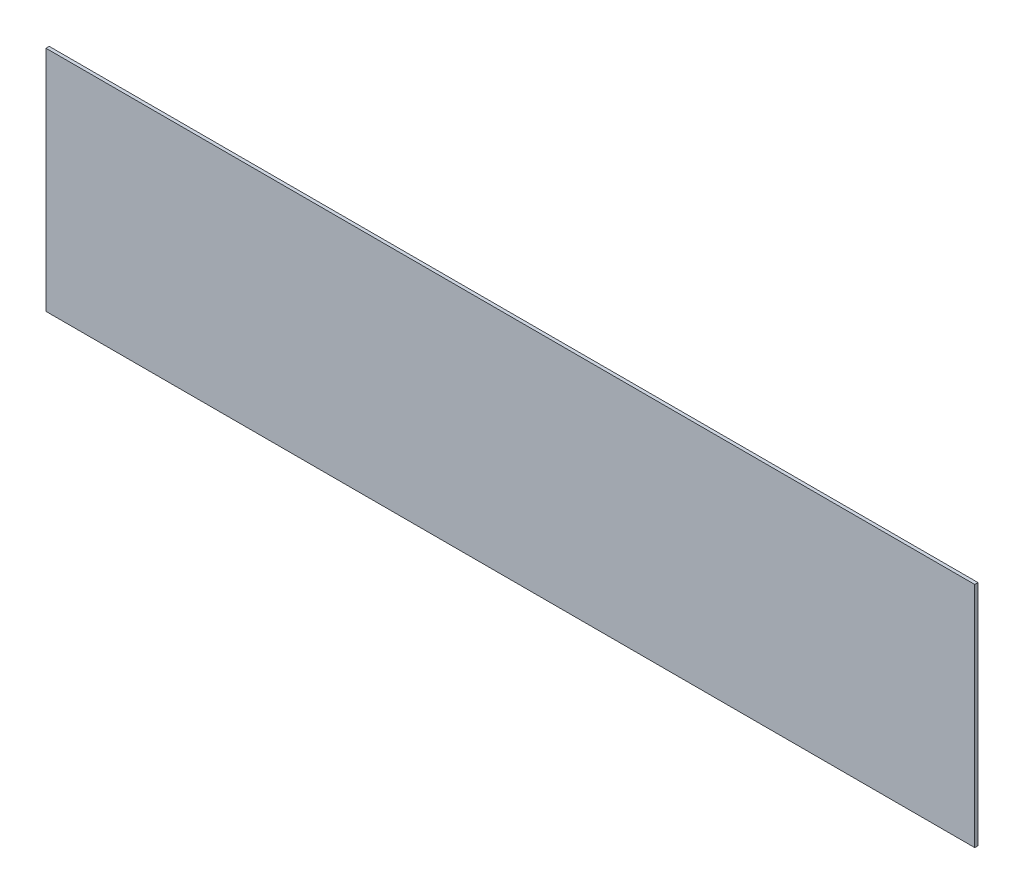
from build123d import *

# Parameters (mm, degrees)
SKETCH1_W      = 56.72
SKETCH1_H      = 13.92
EXTRUDE1_DEPTH = 0.1


with BuildPart() as part:
    # Sketch1 → Extrude1 (new, symmetric)
    with BuildSketch(Plane.XY):
        Rectangle(SKETCH1_W, SKETCH1_H)
    extrude(amount=EXTRUDE1_DEPTH, both=True)


solid = part.part
